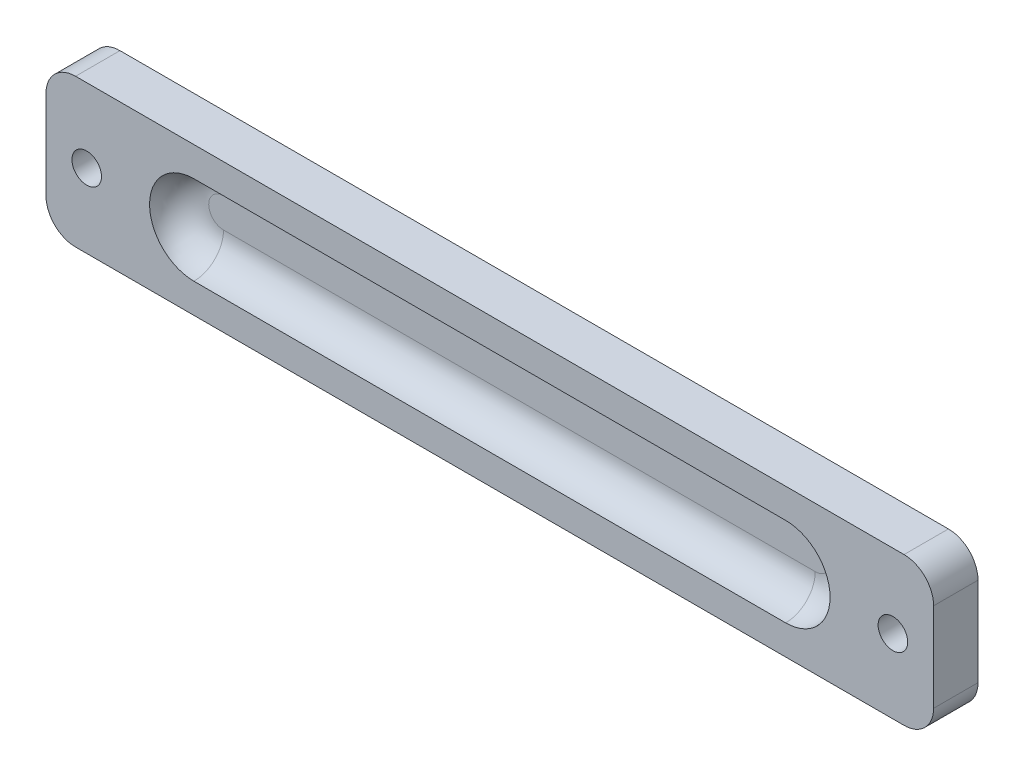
ISO-10303-21;
HEADER;
FILE_DESCRIPTION(('STEP AP214'),'2;1');
FILE_NAME('part.step','',(''),(''),'','','');
FILE_SCHEMA(('AUTOMOTIVE_DESIGN { 1 0 10303 214 1 1 1 1 }'));
ENDSEC;
DATA;
#1=APPLICATION_CONTEXT('core data for automotive mechanical design processes');
#2=APPLICATION_PROTOCOL_DEFINITION('international standard','automotive_design',2000,#1);
#3=PRODUCT_CONTEXT('',#1,'mechanical');
#4=PRODUCT('Part','Part','',(#3));
#5=PRODUCT_RELATED_PRODUCT_CATEGORY('part','',(#4));
#6=PRODUCT_DEFINITION_FORMATION('','',#4);
#7=PRODUCT_DEFINITION_CONTEXT('part definition',#1,'design');
#8=PRODUCT_DEFINITION('design','',#6,#7);
#9=PRODUCT_DEFINITION_SHAPE('','',#8);
#10=(LENGTH_UNIT() NAMED_UNIT(*) SI_UNIT(.MILLI.,.METRE.));
#11=(NAMED_UNIT(*) PLANE_ANGLE_UNIT() SI_UNIT($,.RADIAN.));
#12=(NAMED_UNIT(*) SI_UNIT($,.STERADIAN.) SOLID_ANGLE_UNIT());
#13=UNCERTAINTY_MEASURE_WITH_UNIT(LENGTH_MEASURE(1.E-05),#10,'distance_accuracy_value','');
#14=(GEOMETRIC_REPRESENTATION_CONTEXT(3) GLOBAL_UNCERTAINTY_ASSIGNED_CONTEXT((#13)) GLOBAL_UNIT_ASSIGNED_CONTEXT((#10,
#11,#12)) REPRESENTATION_CONTEXT('',''));
#15=CARTESIAN_POINT('',(0.,0.,0.));
#16=DIRECTION('',(0.,0.,1.));
#17=DIRECTION('',(1.,0.,0.));
#18=AXIS2_PLACEMENT_3D('',#15,#16,#17);
#19=CARTESIAN_POINT('',(0.,0.,9.525));
#20=DIRECTION('',(0.,0.,1.));
#21=DIRECTION('',(1.,0.,0.));
#22=AXIS2_PLACEMENT_3D('',#19,#20,#21);
#23=PLANE('',#22);
#24=CARTESIAN_POINT('',(86.5124,0.,9.525));
#25=DIRECTION('',(0.,0.,1.));
#26=DIRECTION('',(1.,0.,0.));
#27=AXIS2_PLACEMENT_3D('',#24,#25,#26);
#28=CIRCLE('',#27,3.175);
#29=CARTESIAN_POINT('',(83.3374,0.,9.525));
#30=VERTEX_POINT('',#29);
#31=EDGE_CURVE('E300',#30,#30,#28,.T.);
#32=ORIENTED_EDGE('',*,*,#31,.F.);
#33=EDGE_LOOP('',(#32));
#34=FACE_BOUND('',#33,.T.);
#35=DIRECTION('',(-1.,0.,0.));
#36=VECTOR('',#35,1.);
#37=CARTESIAN_POINT('',(95.25,15.875,9.525));
#38=LINE('',#37,#36);
#39=CARTESIAN_POINT('',(88.9,15.875,9.525));
#40=VERTEX_POINT('',#39);
#41=CARTESIAN_POINT('',(-88.9,15.875,9.525));
#42=VERTEX_POINT('',#41);
#43=EDGE_CURVE('E144',#40,#42,#38,.T.);
#44=ORIENTED_EDGE('',*,*,#43,.T.);
#45=CARTESIAN_POINT('',(-88.9,9.525,9.525));
#46=DIRECTION('',(0.,0.,1.));
#47=DIRECTION('',(1.,0.,0.));
#48=AXIS2_PLACEMENT_3D('',#45,#46,#47);
#49=CIRCLE('',#48,6.35);
#50=CARTESIAN_POINT('',(-95.25,9.525,9.525));
#51=VERTEX_POINT('',#50);
#52=EDGE_CURVE('E187',#42,#51,#49,.T.);
#53=ORIENTED_EDGE('',*,*,#52,.T.);
#54=DIRECTION('',(0.,-1.,0.));
#55=VECTOR('',#54,1.);
#56=CARTESIAN_POINT('',(-95.25,15.875,9.525));
#57=LINE('',#56,#55);
#58=CARTESIAN_POINT('',(-95.25,-9.525,9.525));
#59=VERTEX_POINT('',#58);
#60=EDGE_CURVE('E211',#51,#59,#57,.T.);
#61=ORIENTED_EDGE('',*,*,#60,.T.);
#62=CARTESIAN_POINT('',(-88.9,-9.525,9.525));
#63=DIRECTION('',(0.,0.,1.));
#64=DIRECTION('',(1.,0.,0.));
#65=AXIS2_PLACEMENT_3D('',#62,#63,#64);
#66=CIRCLE('',#65,6.35);
#67=CARTESIAN_POINT('',(-88.9,-15.875,9.525));
#68=VERTEX_POINT('',#67);
#69=EDGE_CURVE('E185',#59,#68,#66,.T.);
#70=ORIENTED_EDGE('',*,*,#69,.T.);
#71=DIRECTION('',(1.,0.,0.));
#72=VECTOR('',#71,1.);
#73=CARTESIAN_POINT('',(-95.25,-15.875,9.525));
#74=LINE('',#73,#72);
#75=CARTESIAN_POINT('',(88.9,-15.875,9.525));
#76=VERTEX_POINT('',#75);
#77=EDGE_CURVE('E288',#68,#76,#74,.T.);
#78=ORIENTED_EDGE('',*,*,#77,.T.);
#79=CARTESIAN_POINT('',(88.9,-9.525,9.525));
#80=DIRECTION('',(0.,0.,1.));
#81=DIRECTION('',(1.,0.,0.));
#82=AXIS2_PLACEMENT_3D('',#79,#80,#81);
#83=CIRCLE('',#82,6.35);
#84=CARTESIAN_POINT('',(95.25,-9.525,9.525));
#85=VERTEX_POINT('',#84);
#86=EDGE_CURVE('E53',#76,#85,#83,.T.);
#87=ORIENTED_EDGE('',*,*,#86,.T.);
#88=DIRECTION('',(0.,1.,0.));
#89=VECTOR('',#88,1.);
#90=CARTESIAN_POINT('',(95.25,-15.875,9.525));
#91=LINE('',#90,#89);
#92=CARTESIAN_POINT('',(95.25,9.525,9.525));
#93=VERTEX_POINT('',#92);
#94=EDGE_CURVE('E198',#85,#93,#91,.T.);
#95=ORIENTED_EDGE('',*,*,#94,.T.);
#96=CARTESIAN_POINT('',(88.9,9.525,9.525));
#97=DIRECTION('',(0.,0.,1.));
#98=DIRECTION('',(1.,0.,0.));
#99=AXIS2_PLACEMENT_3D('',#96,#97,#98);
#100=CIRCLE('',#99,6.35);
#101=EDGE_CURVE('E183',#93,#40,#100,.T.);
#102=ORIENTED_EDGE('',*,*,#101,.T.);
#103=EDGE_LOOP('',(#44,#53,#61,#70,#78,#87,#95,#102));
#104=FACE_BOUND('',#103,.T.);
#105=CARTESIAN_POINT('',(-86.5124,0.,9.525));
#106=DIRECTION('',(0.,0.,1.));
#107=DIRECTION('',(1.,0.,0.));
#108=AXIS2_PLACEMENT_3D('',#105,#106,#107);
#109=CIRCLE('',#108,3.175);
#110=CARTESIAN_POINT('',(-89.6874,0.,9.525));
#111=VERTEX_POINT('',#110);
#112=EDGE_CURVE('E292',#111,#111,#109,.T.);
#113=ORIENTED_EDGE('',*,*,#112,.F.);
#114=EDGE_LOOP('',(#113));
#115=FACE_BOUND('',#114,.T.);
#116=DIRECTION('',(1.,0.,0.));
#117=VECTOR('',#116,1.);
#118=CARTESIAN_POINT('',(0.,9.52500000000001,9.525));
#119=LINE('',#118,#117);
#120=CARTESIAN_POINT('',(-63.5,9.52499999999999,9.525));
#121=VERTEX_POINT('',#120);
#122=CARTESIAN_POINT('',(63.5,9.52500000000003,9.525));
#123=VERTEX_POINT('',#122);
#124=EDGE_CURVE('E147',#121,#123,#119,.T.);
#125=ORIENTED_EDGE('',*,*,#124,.T.);
#126=CARTESIAN_POINT('',(63.5,0.,9.525));
#127=DIRECTION('',(0.,0.,1.));
#128=DIRECTION('',(1.,0.,0.));
#129=AXIS2_PLACEMENT_3D('',#126,#127,#128);
#130=CIRCLE('',#129,9.525);
#131=CARTESIAN_POINT('',(63.5,-9.52499999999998,9.525));
#132=VERTEX_POINT('',#131);
#133=EDGE_CURVE('E127',#123,#132,#130,.F.);
#134=ORIENTED_EDGE('',*,*,#133,.T.);
#135=DIRECTION('',(-1.,0.,0.));
#136=VECTOR('',#135,1.);
#137=CARTESIAN_POINT('',(0.,-9.525,9.525));
#138=LINE('',#137,#136);
#139=CARTESIAN_POINT('',(-63.5,-9.52500000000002,9.525));
#140=VERTEX_POINT('',#139);
#141=EDGE_CURVE('E137',#132,#140,#138,.T.);
#142=ORIENTED_EDGE('',*,*,#141,.T.);
#143=CARTESIAN_POINT('',(-63.5,0.,9.525));
#144=DIRECTION('',(0.,0.,1.));
#145=DIRECTION('',(1.,0.,0.));
#146=AXIS2_PLACEMENT_3D('',#143,#144,#145);
#147=CIRCLE('',#146,9.525);
#148=EDGE_CURVE('E143',#140,#121,#147,.F.);
#149=ORIENTED_EDGE('',*,*,#148,.T.);
#150=EDGE_LOOP('',(#125,#134,#142,#149));
#151=FACE_BOUND('',#150,.T.);
#152=ADVANCED_FACE('F33',(#34,#104,#115,#151),#23,.T.);
#153=CARTESIAN_POINT('',(0.,0.,0.));
#154=DIRECTION('',(0.,0.,1.));
#155=DIRECTION('',(1.,0.,0.));
#156=AXIS2_PLACEMENT_3D('',#153,#154,#155);
#157=PLANE('',#156);
#158=CARTESIAN_POINT('',(-86.5124,0.,0.));
#159=DIRECTION('',(0.,0.,1.));
#160=DIRECTION('',(1.,0.,0.));
#161=AXIS2_PLACEMENT_3D('',#158,#159,#160);
#162=CIRCLE('',#161,3.175);
#163=CARTESIAN_POINT('',(-89.6874,0.,0.));
#164=VERTEX_POINT('',#163);
#165=EDGE_CURVE('E295',#164,#164,#162,.T.);
#166=ORIENTED_EDGE('',*,*,#165,.T.);
#167=EDGE_LOOP('',(#166));
#168=FACE_BOUND('',#167,.T.);
#169=DIRECTION('',(0.,-1.,0.));
#170=VECTOR('',#169,1.);
#171=CARTESIAN_POINT('',(-95.25,15.875,0.));
#172=LINE('',#171,#170);
#173=CARTESIAN_POINT('',(-95.25,9.525,0.));
#174=VERTEX_POINT('',#173);
#175=CARTESIAN_POINT('',(-95.25,-9.525,0.));
#176=VERTEX_POINT('',#175);
#177=EDGE_CURVE('E213',#174,#176,#172,.T.);
#178=ORIENTED_EDGE('',*,*,#177,.F.);
#179=CARTESIAN_POINT('',(-88.9,9.525,0.));
#180=DIRECTION('',(0.,0.,1.));
#181=DIRECTION('',(1.,0.,0.));
#182=AXIS2_PLACEMENT_3D('',#179,#180,#181);
#183=CIRCLE('',#182,6.35);
#184=CARTESIAN_POINT('',(-88.9,15.875,0.));
#185=VERTEX_POINT('',#184);
#186=EDGE_CURVE('E175',#174,#185,#183,.F.);
#187=ORIENTED_EDGE('',*,*,#186,.T.);
#188=DIRECTION('',(-1.,0.,0.));
#189=VECTOR('',#188,1.);
#190=CARTESIAN_POINT('',(95.25,15.875,0.));
#191=LINE('',#190,#189);
#192=CARTESIAN_POINT('',(88.9,15.875,0.));
#193=VERTEX_POINT('',#192);
#194=EDGE_CURVE('E207',#193,#185,#191,.T.);
#195=ORIENTED_EDGE('',*,*,#194,.F.);
#196=CARTESIAN_POINT('',(88.9,9.525,0.));
#197=DIRECTION('',(0.,0.,1.));
#198=DIRECTION('',(1.,0.,0.));
#199=AXIS2_PLACEMENT_3D('',#196,#197,#198);
#200=CIRCLE('',#199,6.35);
#201=CARTESIAN_POINT('',(95.25,9.525,0.));
#202=VERTEX_POINT('',#201);
#203=EDGE_CURVE('E171',#193,#202,#200,.F.);
#204=ORIENTED_EDGE('',*,*,#203,.T.);
#205=DIRECTION('',(0.,1.,0.));
#206=VECTOR('',#205,1.);
#207=CARTESIAN_POINT('',(95.25,-15.875,0.));
#208=LINE('',#207,#206);
#209=CARTESIAN_POINT('',(95.25,-9.525,0.));
#210=VERTEX_POINT('',#209);
#211=EDGE_CURVE('E197',#210,#202,#208,.T.);
#212=ORIENTED_EDGE('',*,*,#211,.F.);
#213=CARTESIAN_POINT('',(88.9,-9.525,0.));
#214=DIRECTION('',(0.,0.,1.));
#215=DIRECTION('',(1.,0.,0.));
#216=AXIS2_PLACEMENT_3D('',#213,#214,#215);
#217=CIRCLE('',#216,6.35);
#218=CARTESIAN_POINT('',(88.9,-15.875,0.));
#219=VERTEX_POINT('',#218);
#220=EDGE_CURVE('E169',#210,#219,#217,.F.);
#221=ORIENTED_EDGE('',*,*,#220,.T.);
#222=DIRECTION('',(1.,0.,0.));
#223=VECTOR('',#222,1.);
#224=CARTESIAN_POINT('',(-95.25,-15.875,0.));
#225=LINE('',#224,#223);
#226=CARTESIAN_POINT('',(-88.9,-15.875,0.));
#227=VERTEX_POINT('',#226);
#228=EDGE_CURVE('E208',#227,#219,#225,.T.);
#229=ORIENTED_EDGE('',*,*,#228,.F.);
#230=CARTESIAN_POINT('',(-88.9,-9.525,0.));
#231=DIRECTION('',(0.,0.,1.));
#232=DIRECTION('',(1.,0.,0.));
#233=AXIS2_PLACEMENT_3D('',#230,#231,#232);
#234=CIRCLE('',#233,6.35);
#235=EDGE_CURVE('E173',#227,#176,#234,.F.);
#236=ORIENTED_EDGE('',*,*,#235,.T.);
#237=EDGE_LOOP('',(#178,#187,#195,#204,#212,#221,#229,#236));
#238=FACE_BOUND('',#237,.T.);
#239=CARTESIAN_POINT('',(86.5124,0.,0.));
#240=DIRECTION('',(0.,0.,1.));
#241=DIRECTION('',(1.,0.,0.));
#242=AXIS2_PLACEMENT_3D('',#239,#240,#241);
#243=CIRCLE('',#242,3.175);
#244=CARTESIAN_POINT('',(83.3374,0.,0.));
#245=VERTEX_POINT('',#244);
#246=EDGE_CURVE('E164',#245,#245,#243,.T.);
#247=ORIENTED_EDGE('',*,*,#246,.T.);
#248=EDGE_LOOP('',(#247));
#249=FACE_BOUND('',#248,.T.);
#250=ADVANCED_FACE('F202',(#168,#238,#249),#157,.F.);
#251=CARTESIAN_POINT('',(-95.25,15.875,9.525));
#252=DIRECTION('',(1.,0.,0.));
#253=DIRECTION('',(0.,0.,-1.));
#254=AXIS2_PLACEMENT_3D('',#251,#252,#253);
#255=PLANE('',#254);
#256=ORIENTED_EDGE('',*,*,#60,.F.);
#257=DIRECTION('',(0.,0.,-1.));
#258=VECTOR('',#257,1.);
#259=CARTESIAN_POINT('',(-95.25,9.525,9.525));
#260=LINE('',#259,#258);
#261=EDGE_CURVE('E166',#51,#174,#260,.T.);
#262=ORIENTED_EDGE('',*,*,#261,.T.);
#263=ORIENTED_EDGE('',*,*,#177,.T.);
#264=DIRECTION('',(0.,0.,-1.));
#265=VECTOR('',#264,1.);
#266=CARTESIAN_POINT('',(-95.25,-9.525,9.525));
#267=LINE('',#266,#265);
#268=EDGE_CURVE('E159',#176,#59,#267,.F.);
#269=ORIENTED_EDGE('',*,*,#268,.T.);
#270=EDGE_LOOP('',(#256,#262,#263,#269));
#271=FACE_BOUND('',#270,.T.);
#272=ADVANCED_FACE('F242',(#271),#255,.F.);
#273=CARTESIAN_POINT('',(-95.25,-15.875,9.525));
#274=DIRECTION('',(0.,1.,0.));
#275=DIRECTION('',(0.,0.,1.));
#276=AXIS2_PLACEMENT_3D('',#273,#274,#275);
#277=PLANE('',#276);
#278=ORIENTED_EDGE('',*,*,#77,.F.);
#279=DIRECTION('',(0.,0.,-1.));
#280=VECTOR('',#279,1.);
#281=CARTESIAN_POINT('',(-88.9,-15.875,9.525));
#282=LINE('',#281,#280);
#283=EDGE_CURVE('E191',#68,#227,#282,.T.);
#284=ORIENTED_EDGE('',*,*,#283,.T.);
#285=ORIENTED_EDGE('',*,*,#228,.T.);
#286=DIRECTION('',(0.,0.,-1.));
#287=VECTOR('',#286,1.);
#288=CARTESIAN_POINT('',(88.9,-15.875,9.525));
#289=LINE('',#288,#287);
#290=EDGE_CURVE('E189',#219,#76,#289,.F.);
#291=ORIENTED_EDGE('',*,*,#290,.T.);
#292=EDGE_LOOP('',(#278,#284,#285,#291));
#293=FACE_BOUND('',#292,.T.);
#294=ADVANCED_FACE('F254',(#293),#277,.F.);
#295=CARTESIAN_POINT('',(95.25,-15.875,9.525));
#296=DIRECTION('',(-1.,0.,0.));
#297=DIRECTION('',(0.,0.,1.));
#298=AXIS2_PLACEMENT_3D('',#295,#296,#297);
#299=PLANE('',#298);
#300=ORIENTED_EDGE('',*,*,#211,.T.);
#301=DIRECTION('',(0.,0.,-1.));
#302=VECTOR('',#301,1.);
#303=CARTESIAN_POINT('',(95.25,9.525,9.525));
#304=LINE('',#303,#302);
#305=EDGE_CURVE('E11',#202,#93,#304,.F.);
#306=ORIENTED_EDGE('',*,*,#305,.T.);
#307=ORIENTED_EDGE('',*,*,#94,.F.);
#308=DIRECTION('',(0.,0.,-1.));
#309=VECTOR('',#308,1.);
#310=CARTESIAN_POINT('',(95.25,-9.525,9.525));
#311=LINE('',#310,#309);
#312=EDGE_CURVE('E41',#85,#210,#311,.T.);
#313=ORIENTED_EDGE('',*,*,#312,.T.);
#314=EDGE_LOOP('',(#300,#306,#307,#313));
#315=FACE_BOUND('',#314,.T.);
#316=ADVANCED_FACE('F196',(#315),#299,.F.);
#317=CARTESIAN_POINT('',(95.25,15.875,9.525));
#318=DIRECTION('',(0.,-1.,0.));
#319=DIRECTION('',(0.,0.,-1.));
#320=AXIS2_PLACEMENT_3D('',#317,#318,#319);
#321=PLANE('',#320);
#322=ORIENTED_EDGE('',*,*,#194,.T.);
#323=DIRECTION('',(0.,0.,-1.));
#324=VECTOR('',#323,1.);
#325=CARTESIAN_POINT('',(-88.9,15.875,9.525));
#326=LINE('',#325,#324);
#327=EDGE_CURVE('E180',#185,#42,#326,.F.);
#328=ORIENTED_EDGE('',*,*,#327,.T.);
#329=ORIENTED_EDGE('',*,*,#43,.F.);
#330=DIRECTION('',(0.,0.,-1.));
#331=VECTOR('',#330,1.);
#332=CARTESIAN_POINT('',(88.9,15.875,9.525));
#333=LINE('',#332,#331);
#334=EDGE_CURVE('E177',#40,#193,#333,.T.);
#335=ORIENTED_EDGE('',*,*,#334,.T.);
#336=EDGE_LOOP('',(#322,#328,#329,#335));
#337=FACE_BOUND('',#336,.T.);
#338=ADVANCED_FACE('F248',(#337),#321,.F.);
#339=CARTESIAN_POINT('',(-86.5124,0.,9.525));
#340=DIRECTION('',(0.,0.,-1.));
#341=DIRECTION('',(-1.,0.,0.));
#342=AXIS2_PLACEMENT_3D('',#339,#340,#341);
#343=CYLINDRICAL_SURFACE('',#342,3.175);
#344=CARTESIAN_POINT('',(-89.6874,0.,9.525));
#345=CARTESIAN_POINT('',(-89.6874,0.,9.42578125));
#346=CARTESIAN_POINT('',(-89.6874,0.,9.3265625));
#347=CARTESIAN_POINT('',(-89.6874,0.,9.128125));
#348=CARTESIAN_POINT('',(-89.6874,0.,9.02890625));
#349=CARTESIAN_POINT('',(-89.6874,0.,8.83046875));
#350=CARTESIAN_POINT('',(-89.6874,0.,8.73125));
#351=CARTESIAN_POINT('',(-89.6874,0.,8.5328125));
#352=CARTESIAN_POINT('',(-89.6874,0.,8.43359375));
#353=CARTESIAN_POINT('',(-89.6874,0.,8.23515625));
#354=CARTESIAN_POINT('',(-89.6874,0.,8.1359375));
#355=CARTESIAN_POINT('',(-89.6874,0.,7.9375));
#356=CARTESIAN_POINT('',(-89.6874,0.,7.83828125));
#357=CARTESIAN_POINT('',(-89.6874,0.,7.63984375));
#358=CARTESIAN_POINT('',(-89.6874,0.,7.540625));
#359=CARTESIAN_POINT('',(-89.6874,0.,7.3421875));
#360=CARTESIAN_POINT('',(-89.6874,0.,7.24296875));
#361=CARTESIAN_POINT('',(-89.6874,0.,7.04453125));
#362=CARTESIAN_POINT('',(-89.6874,0.,6.9453125));
#363=CARTESIAN_POINT('',(-89.6874,0.,6.746875));
#364=CARTESIAN_POINT('',(-89.6874,0.,6.64765625));
#365=CARTESIAN_POINT('',(-89.6874,0.,6.44921875));
#366=CARTESIAN_POINT('',(-89.6874,0.,6.35));
#367=CARTESIAN_POINT('',(-89.6874,0.,6.1515625));
#368=CARTESIAN_POINT('',(-89.6874,0.,6.05234375));
#369=CARTESIAN_POINT('',(-89.6874,0.,5.85390625));
#370=CARTESIAN_POINT('',(-89.6874,0.,5.7546875));
#371=CARTESIAN_POINT('',(-89.6874,0.,5.55625));
#372=CARTESIAN_POINT('',(-89.6874,0.,5.45703125));
#373=CARTESIAN_POINT('',(-89.6874,0.,5.25859375));
#374=CARTESIAN_POINT('',(-89.6874,0.,5.159375));
#375=CARTESIAN_POINT('',(-89.6874,0.,4.9609375));
#376=CARTESIAN_POINT('',(-89.6874,0.,4.86171875));
#377=CARTESIAN_POINT('',(-89.6874,0.,4.66328125));
#378=CARTESIAN_POINT('',(-89.6874,0.,4.5640625));
#379=CARTESIAN_POINT('',(-89.6874,0.,4.365625));
#380=CARTESIAN_POINT('',(-89.6874,0.,4.26640625));
#381=CARTESIAN_POINT('',(-89.6874,0.,4.06796875));
#382=CARTESIAN_POINT('',(-89.6874,0.,3.96875));
#383=CARTESIAN_POINT('',(-89.6874,0.,3.7703125));
#384=CARTESIAN_POINT('',(-89.6874,0.,3.67109375));
#385=CARTESIAN_POINT('',(-89.6874,0.,3.47265625));
#386=CARTESIAN_POINT('',(-89.6874,0.,3.3734375));
#387=CARTESIAN_POINT('',(-89.6874,0.,3.175));
#388=CARTESIAN_POINT('',(-89.6874,0.,3.07578125));
#389=CARTESIAN_POINT('',(-89.6874,0.,2.87734375));
#390=CARTESIAN_POINT('',(-89.6874,0.,2.778125));
#391=CARTESIAN_POINT('',(-89.6874,0.,2.5796875));
#392=CARTESIAN_POINT('',(-89.6874,0.,2.48046875));
#393=CARTESIAN_POINT('',(-89.6874,0.,2.28203125));
#394=CARTESIAN_POINT('',(-89.6874,0.,2.1828125));
#395=CARTESIAN_POINT('',(-89.6874,0.,1.984375));
#396=CARTESIAN_POINT('',(-89.6874,0.,1.88515625));
#397=CARTESIAN_POINT('',(-89.6874,0.,1.68671875));
#398=CARTESIAN_POINT('',(-89.6874,0.,1.5875));
#399=CARTESIAN_POINT('',(-89.6874,0.,1.3890625));
#400=CARTESIAN_POINT('',(-89.6874,0.,1.28984375));
#401=CARTESIAN_POINT('',(-89.6874,0.,1.09140625));
#402=CARTESIAN_POINT('',(-89.6874,0.,0.992187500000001));
#403=CARTESIAN_POINT('',(-89.6874,0.,0.793750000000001));
#404=CARTESIAN_POINT('',(-89.6874,0.,0.69453125));
#405=CARTESIAN_POINT('',(-89.6874,0.,0.49609375));
#406=CARTESIAN_POINT('',(-89.6874,0.,0.396875));
#407=CARTESIAN_POINT('',(-89.6874,0.,0.1984375));
#408=CARTESIAN_POINT('',(-89.6874,0.,0.0992187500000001));
#409=CARTESIAN_POINT('',(-89.6874,0.,0.));
#410=B_SPLINE_CURVE_WITH_KNOTS('',3,(#344,#345,#346,#347,#348,#349,#350,#351,#352,#353,#354,
#355,#356,#357,#358,#359,#360,#361,#362,#363,#364,#365,#366,#367,#368,#369,#370,#371,#372,#373,
#374,#375,#376,#377,#378,#379,#380,#381,#382,#383,#384,#385,#386,#387,#388,#389,#390,#391,#392,
#393,#394,#395,#396,#397,#398,#399,#400,#401,#402,#403,#404,#405,#406,#407,#408,#409),
.UNSPECIFIED.,.F.,.F.,(4,2,2,2,2,2,2,2,2,2,2,2,2,2,2,2,2,2,2,2,2,2,2,2,2,2,2,2,2,2,2,2,4),(0.,
0.29765625,0.5953125,0.892968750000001,1.190625,1.48828125,1.7859375,2.08359375,2.38125,
2.67890625,2.9765625,3.27421875,3.571875,3.86953125,4.1671875,4.46484375,4.7625,5.06015625,
5.3578125,5.65546875,5.953125,6.25078125,6.5484375,6.84609375,7.14375,7.44140625,7.7390625,
8.03671875,8.334375,8.63203125,8.9296875,9.22734375,9.525),.UNSPECIFIED.);
#411=EDGE_CURVE('BSEAM233',#111,#164,#410,.T.);
#412=ORIENTED_EDGE('',*,*,#112,.T.);
#413=ORIENTED_EDGE('',*,*,#165,.F.);
#414=ORIENTED_EDGE('',*,*,#411,.T.);
#415=ORIENTED_EDGE('',*,*,#411,.F.);
#416=EDGE_LOOP('',(#412,#414,#413,#415));
#417=FACE_BOUND('',#416,.T.);
#418=ADVANCED_FACE('F233',(#417),#343,.F.);
#419=CARTESIAN_POINT('',(86.5124,0.,9.525));
#420=DIRECTION('',(0.,0.,-1.));
#421=DIRECTION('',(-1.,0.,0.));
#422=AXIS2_PLACEMENT_3D('',#419,#420,#421);
#423=CYLINDRICAL_SURFACE('',#422,3.175);
#424=CARTESIAN_POINT('',(83.3374,0.,9.525));
#425=CARTESIAN_POINT('',(83.3374,0.,9.42578125));
#426=CARTESIAN_POINT('',(83.3374,0.,9.3265625));
#427=CARTESIAN_POINT('',(83.3374,0.,9.128125));
#428=CARTESIAN_POINT('',(83.3374,0.,9.02890625));
#429=CARTESIAN_POINT('',(83.3374,0.,8.83046875));
#430=CARTESIAN_POINT('',(83.3374,0.,8.73125));
#431=CARTESIAN_POINT('',(83.3374,0.,8.5328125));
#432=CARTESIAN_POINT('',(83.3374,0.,8.43359375));
#433=CARTESIAN_POINT('',(83.3374,0.,8.23515625));
#434=CARTESIAN_POINT('',(83.3374,0.,8.1359375));
#435=CARTESIAN_POINT('',(83.3374,0.,7.9375));
#436=CARTESIAN_POINT('',(83.3374,0.,7.83828125));
#437=CARTESIAN_POINT('',(83.3374,0.,7.63984375));
#438=CARTESIAN_POINT('',(83.3374,0.,7.540625));
#439=CARTESIAN_POINT('',(83.3374,0.,7.3421875));
#440=CARTESIAN_POINT('',(83.3374,0.,7.24296875));
#441=CARTESIAN_POINT('',(83.3374,0.,7.04453125));
#442=CARTESIAN_POINT('',(83.3374,0.,6.9453125));
#443=CARTESIAN_POINT('',(83.3374,0.,6.746875));
#444=CARTESIAN_POINT('',(83.3374,0.,6.64765625));
#445=CARTESIAN_POINT('',(83.3374,0.,6.44921875));
#446=CARTESIAN_POINT('',(83.3374,0.,6.35));
#447=CARTESIAN_POINT('',(83.3374,0.,6.1515625));
#448=CARTESIAN_POINT('',(83.3374,0.,6.05234375));
#449=CARTESIAN_POINT('',(83.3374,0.,5.85390625));
#450=CARTESIAN_POINT('',(83.3374,0.,5.7546875));
#451=CARTESIAN_POINT('',(83.3374,0.,5.55625));
#452=CARTESIAN_POINT('',(83.3374,0.,5.45703125));
#453=CARTESIAN_POINT('',(83.3374,0.,5.25859375));
#454=CARTESIAN_POINT('',(83.3374,0.,5.159375));
#455=CARTESIAN_POINT('',(83.3374,0.,4.9609375));
#456=CARTESIAN_POINT('',(83.3374,0.,4.86171875));
#457=CARTESIAN_POINT('',(83.3374,0.,4.66328125));
#458=CARTESIAN_POINT('',(83.3374,0.,4.5640625));
#459=CARTESIAN_POINT('',(83.3374,0.,4.365625));
#460=CARTESIAN_POINT('',(83.3374,0.,4.26640625));
#461=CARTESIAN_POINT('',(83.3374,0.,4.06796875));
#462=CARTESIAN_POINT('',(83.3374,0.,3.96875));
#463=CARTESIAN_POINT('',(83.3374,0.,3.7703125));
#464=CARTESIAN_POINT('',(83.3374,0.,3.67109375));
#465=CARTESIAN_POINT('',(83.3374,0.,3.47265625));
#466=CARTESIAN_POINT('',(83.3374,0.,3.3734375));
#467=CARTESIAN_POINT('',(83.3374,0.,3.175));
#468=CARTESIAN_POINT('',(83.3374,0.,3.07578125));
#469=CARTESIAN_POINT('',(83.3374,0.,2.87734375));
#470=CARTESIAN_POINT('',(83.3374,0.,2.778125));
#471=CARTESIAN_POINT('',(83.3374,0.,2.5796875));
#472=CARTESIAN_POINT('',(83.3374,0.,2.48046875));
#473=CARTESIAN_POINT('',(83.3374,0.,2.28203125));
#474=CARTESIAN_POINT('',(83.3374,0.,2.1828125));
#475=CARTESIAN_POINT('',(83.3374,0.,1.984375));
#476=CARTESIAN_POINT('',(83.3374,0.,1.88515625));
#477=CARTESIAN_POINT('',(83.3374,0.,1.68671875));
#478=CARTESIAN_POINT('',(83.3374,0.,1.5875));
#479=CARTESIAN_POINT('',(83.3374,0.,1.3890625));
#480=CARTESIAN_POINT('',(83.3374,0.,1.28984375));
#481=CARTESIAN_POINT('',(83.3374,0.,1.09140625));
#482=CARTESIAN_POINT('',(83.3374,0.,0.992187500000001));
#483=CARTESIAN_POINT('',(83.3374,0.,0.793750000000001));
#484=CARTESIAN_POINT('',(83.3374,0.,0.69453125));
#485=CARTESIAN_POINT('',(83.3374,0.,0.49609375));
#486=CARTESIAN_POINT('',(83.3374,0.,0.396875));
#487=CARTESIAN_POINT('',(83.3374,0.,0.1984375));
#488=CARTESIAN_POINT('',(83.3374,0.,0.0992187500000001));
#489=CARTESIAN_POINT('',(83.3374,0.,0.));
#490=B_SPLINE_CURVE_WITH_KNOTS('',3,(#424,#425,#426,#427,#428,#429,#430,#431,#432,#433,#434,
#435,#436,#437,#438,#439,#440,#441,#442,#443,#444,#445,#446,#447,#448,#449,#450,#451,#452,#453,
#454,#455,#456,#457,#458,#459,#460,#461,#462,#463,#464,#465,#466,#467,#468,#469,#470,#471,#472,
#473,#474,#475,#476,#477,#478,#479,#480,#481,#482,#483,#484,#485,#486,#487,#488,#489),
.UNSPECIFIED.,.F.,.F.,(4,2,2,2,2,2,2,2,2,2,2,2,2,2,2,2,2,2,2,2,2,2,2,2,2,2,2,2,2,2,2,2,4),(0.,
0.29765625,0.5953125,0.892968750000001,1.190625,1.48828125,1.7859375,2.08359375,2.38125,
2.67890625,2.9765625,3.27421875,3.571875,3.86953125,4.1671875,4.46484375,4.7625,5.06015625,
5.3578125,5.65546875,5.953125,6.25078125,6.5484375,6.84609375,7.14375,7.44140625,7.7390625,
8.03671875,8.334375,8.63203125,8.9296875,9.22734375,9.525),.UNSPECIFIED.);
#491=EDGE_CURVE('BSEAM226',#30,#245,#490,.T.);
#492=ORIENTED_EDGE('',*,*,#31,.T.);
#493=ORIENTED_EDGE('',*,*,#246,.F.);
#494=ORIENTED_EDGE('',*,*,#491,.T.);
#495=ORIENTED_EDGE('',*,*,#491,.F.);
#496=EDGE_LOOP('',(#492,#494,#493,#495));
#497=FACE_BOUND('',#496,.T.);
#498=ADVANCED_FACE('F226',(#497),#423,.F.);
#499=CARTESIAN_POINT('',(63.5,0.,3.175));
#500=DIRECTION('',(0.,0.,1.));
#501=DIRECTION('',(1.,0.,0.));
#502=AXIS2_PLACEMENT_3D('',#499,#500,#501);
#503=PLANE('',#502);
#504=DIRECTION('',(1.,0.,0.));
#505=VECTOR('',#504,1.);
#506=CARTESIAN_POINT('',(63.5,-3.17499999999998,3.175));
#507=LINE('',#506,#505);
#508=CARTESIAN_POINT('',(-63.5,-3.17500000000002,3.175));
#509=VERTEX_POINT('',#508);
#510=CARTESIAN_POINT('',(63.5,-3.17499999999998,3.175));
#511=VERTEX_POINT('',#510);
#512=EDGE_CURVE('E156',#509,#511,#507,.T.);
#513=ORIENTED_EDGE('',*,*,#512,.T.);
#514=CARTESIAN_POINT('',(63.5,0.,3.175));
#515=DIRECTION('',(0.,0.,1.));
#516=DIRECTION('',(1.,0.,0.));
#517=AXIS2_PLACEMENT_3D('',#514,#515,#516);
#518=CIRCLE('',#517,3.175);
#519=CARTESIAN_POINT('',(63.5,3.17500000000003,3.175));
#520=VERTEX_POINT('',#519);
#521=EDGE_CURVE('E130',#511,#520,#518,.T.);
#522=ORIENTED_EDGE('',*,*,#521,.T.);
#523=DIRECTION('',(-1.,0.,0.));
#524=VECTOR('',#523,1.);
#525=CARTESIAN_POINT('',(-63.5,3.17499999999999,3.175));
#526=LINE('',#525,#524);
#527=CARTESIAN_POINT('',(-63.5,3.17499999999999,3.175));
#528=VERTEX_POINT('',#527);
#529=EDGE_CURVE('E148',#520,#528,#526,.T.);
#530=ORIENTED_EDGE('',*,*,#529,.T.);
#531=CARTESIAN_POINT('',(-63.5,0.,3.175));
#532=DIRECTION('',(0.,0.,1.));
#533=DIRECTION('',(1.,0.,0.));
#534=AXIS2_PLACEMENT_3D('',#531,#532,#533);
#535=CIRCLE('',#534,3.175);
#536=EDGE_CURVE('E150',#528,#509,#535,.T.);
#537=ORIENTED_EDGE('',*,*,#536,.T.);
#538=EDGE_LOOP('',(#513,#522,#530,#537));
#539=FACE_BOUND('',#538,.T.);
#540=ADVANCED_FACE('F224',(#539),#503,.T.);
#541=CARTESIAN_POINT('',(-63.5,0.,9.525));
#542=DIRECTION('',(0.,0.,1.));
#543=DIRECTION('',(1.,0.,0.));
#544=AXIS2_PLACEMENT_3D('',#541,#542,#543);
#545=DEGENERATE_TOROIDAL_SURFACE('',#544,3.175,6.35,.T.);
#546=CARTESIAN_POINT('',(-63.5,3.17499999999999,9.525));
#547=DIRECTION('',(-1.,0.,0.));
#548=DIRECTION('',(0.,0.,1.));
#549=AXIS2_PLACEMENT_3D('',#546,#547,#548);
#550=CIRCLE('',#549,6.35);
#551=EDGE_CURVE('E133',#121,#528,#550,.T.);
#552=ORIENTED_EDGE('',*,*,#551,.F.);
#553=ORIENTED_EDGE('',*,*,#148,.F.);
#554=CARTESIAN_POINT('',(-63.5,-3.17500000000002,9.525));
#555=DIRECTION('',(-1.,0.,0.));
#556=DIRECTION('',(0.,0.,1.));
#557=AXIS2_PLACEMENT_3D('',#554,#555,#556);
#558=CIRCLE('',#557,6.35);
#559=EDGE_CURVE('E140',#509,#140,#558,.T.);
#560=ORIENTED_EDGE('',*,*,#559,.F.);
#561=ORIENTED_EDGE('',*,*,#536,.F.);
#562=EDGE_LOOP('',(#552,#553,#560,#561));
#563=FACE_BOUND('',#562,.T.);
#564=ADVANCED_FACE('F219',(#563),#545,.F.);
#565=CARTESIAN_POINT('',(63.5,-3.17499999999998,9.525));
#566=DIRECTION('',(-1.,0.,0.));
#567=DIRECTION('',(0.,-1.,0.));
#568=AXIS2_PLACEMENT_3D('',#565,#566,#567);
#569=CYLINDRICAL_SURFACE('',#568,6.35);
#570=ORIENTED_EDGE('',*,*,#559,.T.);
#571=ORIENTED_EDGE('',*,*,#141,.F.);
#572=CARTESIAN_POINT('',(63.5,-3.17499999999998,9.525));
#573=DIRECTION('',(-1.,0.,0.));
#574=DIRECTION('',(0.,0.,1.));
#575=AXIS2_PLACEMENT_3D('',#572,#573,#574);
#576=CIRCLE('',#575,6.35);
#577=EDGE_CURVE('E123',#511,#132,#576,.T.);
#578=ORIENTED_EDGE('',*,*,#577,.F.);
#579=ORIENTED_EDGE('',*,*,#512,.F.);
#580=EDGE_LOOP('',(#570,#571,#578,#579));
#581=FACE_BOUND('',#580,.T.);
#582=ADVANCED_FACE('F138',(#581),#569,.F.);
#583=CARTESIAN_POINT('',(63.5,3.17500000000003,9.525));
#584=DIRECTION('',(1.,0.,0.));
#585=DIRECTION('',(0.,1.,0.));
#586=AXIS2_PLACEMENT_3D('',#583,#584,#585);
#587=CYLINDRICAL_SURFACE('',#586,6.35);
#588=ORIENTED_EDGE('',*,*,#551,.T.);
#589=ORIENTED_EDGE('',*,*,#529,.F.);
#590=CARTESIAN_POINT('',(63.5,3.17500000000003,9.525));
#591=DIRECTION('',(-1.,0.,0.));
#592=DIRECTION('',(0.,0.,1.));
#593=AXIS2_PLACEMENT_3D('',#590,#591,#592);
#594=CIRCLE('',#593,6.35);
#595=EDGE_CURVE('E134',#123,#520,#594,.T.);
#596=ORIENTED_EDGE('',*,*,#595,.F.);
#597=ORIENTED_EDGE('',*,*,#124,.F.);
#598=EDGE_LOOP('',(#588,#589,#596,#597));
#599=FACE_BOUND('',#598,.T.);
#600=ADVANCED_FACE('F222',(#599),#587,.F.);
#601=CARTESIAN_POINT('',(63.5,0.,9.525));
#602=DIRECTION('',(0.,0.,1.));
#603=DIRECTION('',(1.,0.,0.));
#604=AXIS2_PLACEMENT_3D('',#601,#602,#603);
#605=DEGENERATE_TOROIDAL_SURFACE('',#604,3.175,6.35,.T.);
#606=ORIENTED_EDGE('',*,*,#577,.T.);
#607=ORIENTED_EDGE('',*,*,#133,.F.);
#608=ORIENTED_EDGE('',*,*,#595,.T.);
#609=ORIENTED_EDGE('',*,*,#521,.F.);
#610=EDGE_LOOP('',(#606,#607,#608,#609));
#611=FACE_BOUND('',#610,.T.);
#612=ADVANCED_FACE('F125',(#611),#605,.F.);
#613=CARTESIAN_POINT('',(-88.9,9.525,9.525));
#614=DIRECTION('',(0.,0.,-1.));
#615=DIRECTION('',(-1.,0.,0.));
#616=AXIS2_PLACEMENT_3D('',#613,#614,#615);
#617=CYLINDRICAL_SURFACE('',#616,6.35);
#618=ORIENTED_EDGE('',*,*,#52,.F.);
#619=ORIENTED_EDGE('',*,*,#327,.F.);
#620=ORIENTED_EDGE('',*,*,#186,.F.);
#621=ORIENTED_EDGE('',*,*,#261,.F.);
#622=EDGE_LOOP('',(#618,#619,#620,#621));
#623=FACE_BOUND('',#622,.T.);
#624=ADVANCED_FACE('F263',(#623),#617,.T.);
#625=CARTESIAN_POINT('',(-88.9,-9.525,9.525));
#626=DIRECTION('',(0.,0.,-1.));
#627=DIRECTION('',(-1.,0.,0.));
#628=AXIS2_PLACEMENT_3D('',#625,#626,#627);
#629=CYLINDRICAL_SURFACE('',#628,6.35);
#630=ORIENTED_EDGE('',*,*,#69,.F.);
#631=ORIENTED_EDGE('',*,*,#268,.F.);
#632=ORIENTED_EDGE('',*,*,#235,.F.);
#633=ORIENTED_EDGE('',*,*,#283,.F.);
#634=EDGE_LOOP('',(#630,#631,#632,#633));
#635=FACE_BOUND('',#634,.T.);
#636=ADVANCED_FACE('F270',(#635),#629,.T.);
#637=CARTESIAN_POINT('',(88.9,9.525,9.525));
#638=DIRECTION('',(0.,0.,-1.));
#639=DIRECTION('',(-1.,0.,0.));
#640=AXIS2_PLACEMENT_3D('',#637,#638,#639);
#641=CYLINDRICAL_SURFACE('',#640,6.35);
#642=ORIENTED_EDGE('',*,*,#101,.F.);
#643=ORIENTED_EDGE('',*,*,#305,.F.);
#644=ORIENTED_EDGE('',*,*,#203,.F.);
#645=ORIENTED_EDGE('',*,*,#334,.F.);
#646=EDGE_LOOP('',(#642,#643,#644,#645));
#647=FACE_BOUND('',#646,.T.);
#648=ADVANCED_FACE('F273',(#647),#641,.T.);
#649=CARTESIAN_POINT('',(88.9,-9.525,9.525));
#650=DIRECTION('',(0.,0.,-1.));
#651=DIRECTION('',(-1.,0.,0.));
#652=AXIS2_PLACEMENT_3D('',#649,#650,#651);
#653=CYLINDRICAL_SURFACE('',#652,6.35);
#654=ORIENTED_EDGE('',*,*,#86,.F.);
#655=ORIENTED_EDGE('',*,*,#290,.F.);
#656=ORIENTED_EDGE('',*,*,#220,.F.);
#657=ORIENTED_EDGE('',*,*,#312,.F.);
#658=EDGE_LOOP('',(#654,#655,#656,#657));
#659=FACE_BOUND('',#658,.T.);
#660=ADVANCED_FACE('F35',(#659),#653,.T.);
#661=CLOSED_SHELL('',(#152,#250,#272,#294,#316,#338,#418,#498,#540,#564,#582,#600,#612,#624,
#636,#648,#660));
#662=MANIFOLD_SOLID_BREP('B2',#661);
#663=ADVANCED_BREP_SHAPE_REPRESENTATION('',(#18,#662),#14);
#664=SHAPE_DEFINITION_REPRESENTATION(#9,#663);
ENDSEC;
END-ISO-10303-21;
